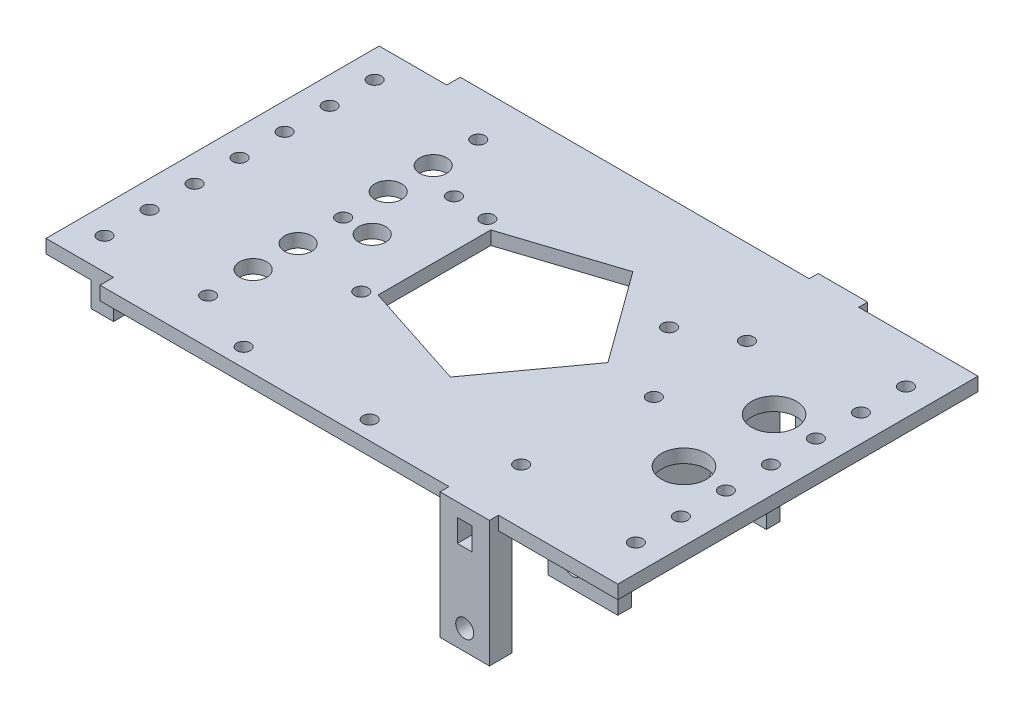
from build123d import *

# Parameters (mm, degrees)
ESBO_O1_W                 = 130
ESBO_O1_H                 = 80
ESBO_O1_R                 = 1.5
ESBO_O1_R_2               = 5
RESSALTO_EXTRUS_O1_DEPTH  = 3
ESBO_O2_W                 = 5
ESBO_O2_H                 = 80
RESSALTO_EXTRUS_O3_DEPTH  = 11
ESBO_O6_R                 = 2.75
CORTE_EXTRUS_O3_DEPTH     = 130.630338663
ESBO_O7_W                 = 15.5
ESBO_O7_H                 = 3
ESBO_O7_W_2               = 11
RESSALTO_EXTRUS_O7_DEPTH  = 25
ESBO_O11_R                = 2
ESBO_O11_W                = 3.3
ESBO_O11_H                = 5
CORTE_EXTRUS_O5_DEPTH     = 108.823166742
ESBO_O9_W                 = 4.5
ESBO_O9_H                 = 30
RESSALTO_EXTRUS_O8_DEPTH  = 20
ESBO_O12_R                = 3
CORTE_EXTRUS_O7_DEPTH     = 10
ESBO_O13_W                = 15
ESBO_O13_H                = 3
CORTE_EXTRUS_O8_DEPTH     = 88.566317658
RESSALTO_EXTRUS_O9_START  = 2
ESBO_O14_W                = 11
ESBO_O14_H                = 28
ESBO_O14_R                = 2
ESBO_O14_W_2              = 3.3
ESBO_O14_H_2              = 5
RESSALTO_EXTRUS_O9_DEPTH  = 2
ESBO_O16_W                = 11
ESBO_O16_H                = 28
ESBO_O16_R                = 2
ESBO_O16_W_2              = 3.3
ESBO_O16_H_2              = 5
RESSALTO_EXTRUS_O10_DEPTH = 2
ESBO_O18_R                = 1.5
CORTE_EXTRUS_O9_DEPTH     = 10
ESBO_O19_R                = 3
CORTE_EXTRUS_O10_DEPTH    = 10


with BuildPart() as part:
    # Esbo_o1 → Ressalto-extrus_o1 (new body)
    with BuildSketch(Plane(origin=(0, 0, 0), x_dir=(1, 0, 0), z_dir=(0, 1, 0))):
        with Locations((-2.829457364, -7.781007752)):
            Rectangle(ESBO_O1_W, ESBO_O1_H)
        with Locations(Location((-25.029457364, -43.686437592, 0), (0, 0, 270))):
            Circle(ESBO_O1_R, mode=Mode.SUBTRACT)
        with Locations(Location((2.970542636, -43.686437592, 0), (0, 0, 270))):
            Circle(ESBO_O1_R, mode=Mode.SUBTRACT)
        with Locations(Location((-30.618508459, 8.614063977, 0), (0, 0, 270))):
            Circle(ESBO_O1_R, mode=Mode.SUBTRACT)
        with Locations(Location((18.470542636, 7.313562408, 0), (0, 0, 270))):
            Circle(ESBO_O1_R, mode=Mode.SUBTRACT)
        with Locations(Location((30.170542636, -7.781007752, 0), (0, 0, 270))):
            Circle(ESBO_O1_R, mode=Mode.SUBTRACT)
        with Locations(Location((-61.829457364, 22.218992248, 0), (0, 0, 270))):
            Circle(ESBO_O1_R, mode=Mode.SUBTRACT)
        with Locations(Location((-61.829457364, 12.218992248, 0), (0, 0, 270))):
            Circle(ESBO_O1_R, mode=Mode.SUBTRACT)
        with Locations(Location((-61.829457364, 2.218992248, 0), (0, 0, 270))):
            Circle(ESBO_O1_R, mode=Mode.SUBTRACT)
        with Locations(Location((-61.829457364, -7.781007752, 0), (0, 0, 270))):
            Circle(ESBO_O1_R, mode=Mode.SUBTRACT)
        with Locations(Location((-61.829457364, -17.781007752, 0), (0, 0, 270))):
            Circle(ESBO_O1_R, mode=Mode.SUBTRACT)
        with Locations(Location((-61.829457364, -27.781007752, 0), (0, 0, 270))):
            Circle(ESBO_O1_R, mode=Mode.SUBTRACT)
        with Locations(Location((-61.829457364, -37.781007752, 0), (0, 0, 270))):
            Circle(ESBO_O1_R, mode=Mode.SUBTRACT)
        with Locations(Location((56.170542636, 22.218992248, 0), (0, 0, 270))):
            Circle(ESBO_O1_R, mode=Mode.SUBTRACT)
        with Locations(Location((56.170542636, 12.218992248, 0), (0, 0, 270))):
            Circle(ESBO_O1_R, mode=Mode.SUBTRACT)
        with Locations(Location((56.170542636, 2.218992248, 0), (0, 0, 270))):
            Circle(ESBO_O1_R, mode=Mode.SUBTRACT)
        with Locations(Location((56.170542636, -7.781007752, 0), (0, 0, 270))):
            Circle(ESBO_O1_R, mode=Mode.SUBTRACT)
        with Locations(Location((56.170542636, -17.781007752, 0), (0, 0, 270))):
            Circle(ESBO_O1_R, mode=Mode.SUBTRACT)
        with Locations(Location((56.170542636, -27.781007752, 0), (0, 0, 270))):
            Circle(ESBO_O1_R, mode=Mode.SUBTRACT)
        with Locations(Location((56.170542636, -37.781007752, 0), (0, 0, 270))):
            Circle(ESBO_O1_R, mode=Mode.SUBTRACT)
        with Locations(Location((46.87186125, 2.218992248, 0), (0, 0, 270))):
            Circle(ESBO_O1_R_2, mode=Mode.SUBTRACT)
        with Locations(Location((46.87186125, -17.781007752, 0), (0, 0, 270))):
            Circle(ESBO_O1_R_2, mode=Mode.SUBTRACT)
        with Locations(Location((-38.829457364, 22.218992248, 0), (0, 0, 270))):
            Circle(ESBO_O1_R, mode=Mode.SUBTRACT)
        with Locations(Location((-38.829457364, 12.218992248, 0), (0, 0, 270))):
            Circle(ESBO_O1_R, mode=Mode.SUBTRACT)
        with Locations(Location((-38.829457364, 2.218992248, 0), (0, 0, 270))):
            Circle(ESBO_O1_R, mode=Mode.SUBTRACT)
        with Locations(Location((-38.829457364, -7.781007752, 0), (0, 0, 270))):
            Circle(ESBO_O1_R, mode=Mode.SUBTRACT)
        with Locations(Location((-38.829457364, -17.781007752, 0), (0, 0, 270))):
            Circle(ESBO_O1_R, mode=Mode.SUBTRACT)
        with Locations(Location((-38.829457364, -27.781007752, 0), (0, 0, 270))):
            Circle(ESBO_O1_R, mode=Mode.SUBTRACT)
        with Locations(Location((-38.829457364, -37.781007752, 0), (0, 0, 270))):
            Circle(ESBO_O1_R, mode=Mode.SUBTRACT)
        Polygon((-30.629457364, -43.686437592), (-30.618508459, -43.686437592), (-30.618508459, -43.698818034), align=None, mode=Mode.SUBTRACT)
        Polygon((18.470542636, -6.281007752), (3.752604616, 13.976496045), (-20.061519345, 6.238818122), (-20.061519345, -18.800833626), (3.752604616, -26.538511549), align=None, mode=Mode.SUBTRACT)
    extrude(amount=RESSALTO_EXTRUS_O1_DEPTH)

    # Esbo_o2 → Ressalto-extrus_o3 (add)
    with BuildSketch(Plane.XZ):
        with Locations((-55.329457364, 7.781007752)):
            Rectangle(ESBO_O2_W, ESBO_O2_H)
    extrude(amount=RESSALTO_EXTRUS_O3_DEPTH)

    # Esbo_o6 → Corte-extrus_o3 (cut, through all)
    with BuildSketch(Plane.ZY.offset(57.829457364)):
        Polygon((-12.218992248, -5.5), (-32.218992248, -5.5), (-32.218992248, -11), (-8.218992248, -11), align=None)
        with Locations((-2.218992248, -5.5)):
            Circle(ESBO_O6_R)
        with Locations((17.781007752, -5.5)):
            Circle(ESBO_O6_R)
        Polygon((27.781007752, -5.5), (23.781007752, -11), (47.781007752, -11), (47.781007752, -5.5), align=None)
    extrude(amount=-CORTE_EXTRUS_O3_DEPTH, mode=Mode.SUBTRACT)

    # Esbo_o7 → Ressalto-extrus_o7 (add)
    with BuildSketch(Plane.XZ):
        with Locations((32.420542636, -8.718992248)):
            Rectangle(ESBO_O7_W, ESBO_O7_H)
        with Locations((32.420542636, 24.281007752)):
            Rectangle(ESBO_O7_W, ESBO_O7_H)
        with Locations((30.170542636, -30.718992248)):
            Rectangle(ESBO_O7_W_2, ESBO_O7_H)
        with Locations((30.170542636, 46.281007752)):
            Rectangle(ESBO_O7_W_2, ESBO_O7_H)
    extrude(amount=RESSALTO_EXTRUS_O7_DEPTH)

    # Esbo_o11 → Corte-extrus_o5 (cut, through all)
    with BuildSketch(Plane.XY.offset(47.781007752)):
        with Locations((30.170542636, -20.5)):
            Circle(ESBO_O11_R)
        with Locations((30.170542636, -2.5)):
            Rectangle(ESBO_O11_W, ESBO_O11_H)
    extrude(amount=-CORTE_EXTRUS_O5_DEPTH, mode=Mode.SUBTRACT)

    # Esbo_o9 → Ressalto-extrus_o8 (add)
    with BuildSketch(Plane.XZ):
        with Locations((37.920542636, 7.781007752)):
            Rectangle(ESBO_O9_W, ESBO_O9_H)
    extrude(amount=RESSALTO_EXTRUS_O8_DEPTH)

    # Esbo_o12 → Corte-extrus_o7 (cut)
    with BuildSketch(Plane(origin=(40.170542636, 0, 0), x_dir=(0, 0, -1), z_dir=(1, 0, 0))):
        with Locations((-12.781007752, -10)):
            Circle(ESBO_O12_R)
        with Locations((-2.781007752, -10)):
            Circle(ESBO_O12_R)
    extrude(amount=-CORTE_EXTRUS_O7_DEPTH, mode=Mode.SUBTRACT)

    # Esbo_o13 → Corte-extrus_o8 (cut, through all)
    with BuildSketch(Plane(origin=(0, 3, 0), x_dir=(1, 0, 0), z_dir=(0, 1, 0))):
        with Locations((-60.329457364, -46.281007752)):
            Rectangle(ESBO_O13_W, ESBO_O13_H)
        with Locations((-60.329457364, 30.718992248)):
            Rectangle(ESBO_O13_W, ESBO_O13_H)
    extrude(amount=-CORTE_EXTRUS_O8_DEPTH, mode=Mode.SUBTRACT)

    # Esbo_o14 → Ressalto-extrus_o9 (add)
    with BuildSketch(Plane.XY.offset(47.781007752).offset(RESSALTO_EXTRUS_O9_START)):
        with Locations((30.170542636, -11)):
            Rectangle(ESBO_O14_W, ESBO_O14_H)
        with Locations((30.170542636, -20.5)):
            Circle(ESBO_O14_R, mode=Mode.SUBTRACT)
        with Locations((30.170542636, -2.5)):
            Rectangle(ESBO_O14_W_2, ESBO_O14_H_2, mode=Mode.SUBTRACT)
    extrude(amount=-RESSALTO_EXTRUS_O9_DEPTH)

    # Esbo_o16 → Ressalto-extrus_o10 (add)
    with BuildSketch(Plane(origin=(0, 0, -32.218992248), x_dir=(-1, 0, 0), z_dir=(0, 0, -1))):
        with Locations((-30.170542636, -11)):
            Rectangle(ESBO_O16_W, ESBO_O16_H)
        with Locations(Location((-30.170542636, -20.5, 0), (0, 0, 180))):
            Circle(ESBO_O16_R, mode=Mode.SUBTRACT)
        with Locations((-30.170542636, -2.5)):
            Rectangle(ESBO_O16_W_2, ESBO_O16_H_2, mode=Mode.SUBTRACT)
    extrude(amount=RESSALTO_EXTRUS_O10_DEPTH)

    # Esbo_o18 → Corte-extrus_o9 (cut)
    with BuildSketch(Plane(origin=(0, 3, 0), x_dir=(1, 0, 0), z_dir=(0, 1, 0))):
        with Locations(Location((-22.567272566, 7.977334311, 0), (0, 0, 270))):
            Circle(ESBO_O18_R)
        with Locations(Location((-22.567272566, -20.022665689, 0), (0, 0, 270))):
            Circle(ESBO_O18_R)
        with Locations(Location((29.732727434, 13.337334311, 0), (0, 0, 270))):
            Circle(ESBO_O18_R)
        with Locations(Location((28.432727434, -35.522665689, 0), (0, 0, 270))):
            Circle(ESBO_O18_R)
    extrude(amount=-CORTE_EXTRUS_O9_DEPTH, mode=Mode.SUBTRACT)

    # Esbo_o19 → Corte-extrus_o10 (cut)
    with BuildSketch(Plane(origin=(0, 3, 0), x_dir=(1, 0, 0), z_dir=(0, 1, 0))):
        with Locations(Location((-38.829457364, 12.218992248, 0), (0, 0, 270))):
            Circle(ESBO_O19_R)
        with Locations(Location((-38.829457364, 2.218992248, 0), (0, 0, 270))):
            Circle(ESBO_O19_R)
        with Locations(Location((-38.829457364, -17.781007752, 0), (0, 0, 270))):
            Circle(ESBO_O19_R)
        with Locations(Location((-38.829457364, -27.781007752, 0), (0, 0, 270))):
            Circle(ESBO_O19_R)
        with Locations(Location((-32.380932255, -7.781007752, 0), (0, 0, 270))):
            Circle(ESBO_O19_R)
    extrude(amount=-CORTE_EXTRUS_O10_DEPTH, mode=Mode.SUBTRACT)


solid = part.part
